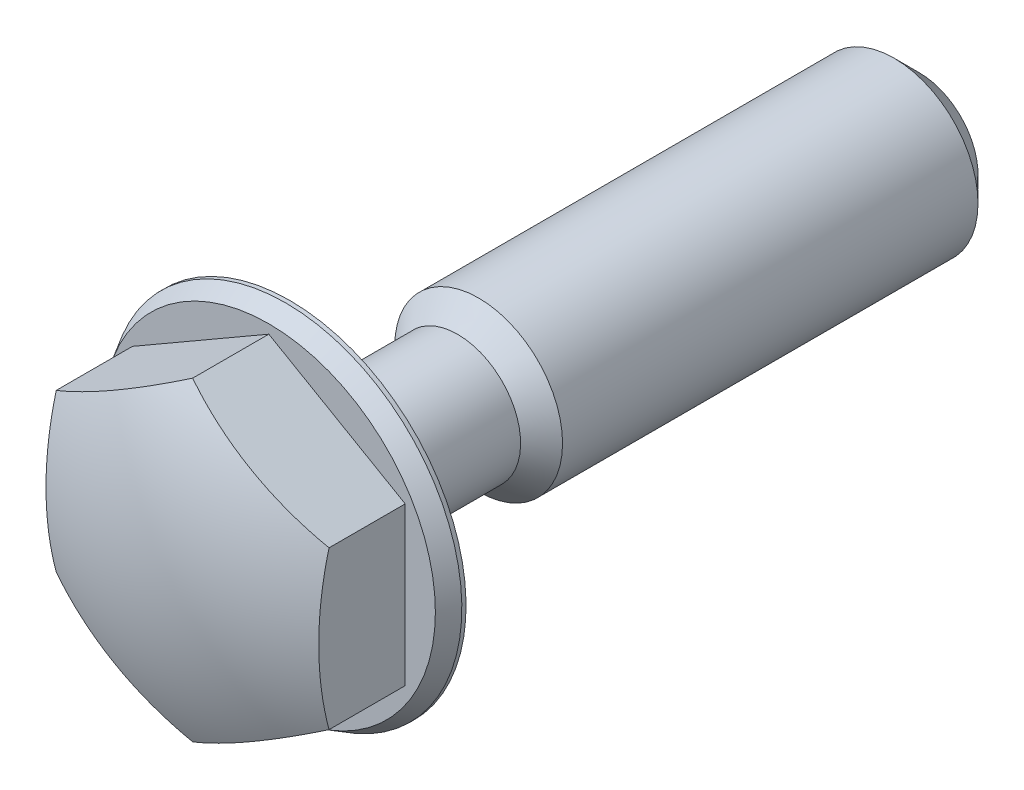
ISO-10303-21;
HEADER;
FILE_DESCRIPTION(('STEP AP214'),'2;1');
FILE_NAME('part.step','',(''),(''),'','','');
FILE_SCHEMA(('AUTOMOTIVE_DESIGN { 1 0 10303 214 1 1 1 1 }'));
ENDSEC;
DATA;
#1=APPLICATION_CONTEXT('core data for automotive mechanical design processes');
#2=APPLICATION_PROTOCOL_DEFINITION('international standard','automotive_design',2000,#1);
#3=PRODUCT_CONTEXT('',#1,'mechanical');
#4=PRODUCT('Part','Part','',(#3));
#5=PRODUCT_RELATED_PRODUCT_CATEGORY('part','',(#4));
#6=PRODUCT_DEFINITION_FORMATION('','',#4);
#7=PRODUCT_DEFINITION_CONTEXT('part definition',#1,'design');
#8=PRODUCT_DEFINITION('design','',#6,#7);
#9=PRODUCT_DEFINITION_SHAPE('','',#8);
#10=(LENGTH_UNIT() NAMED_UNIT(*) SI_UNIT(.MILLI.,.METRE.));
#11=(NAMED_UNIT(*) PLANE_ANGLE_UNIT() SI_UNIT($,.RADIAN.));
#12=(NAMED_UNIT(*) SI_UNIT($,.STERADIAN.) SOLID_ANGLE_UNIT());
#13=UNCERTAINTY_MEASURE_WITH_UNIT(LENGTH_MEASURE(1.E-05),#10,'distance_accuracy_value','');
#14=(GEOMETRIC_REPRESENTATION_CONTEXT(3) GLOBAL_UNCERTAINTY_ASSIGNED_CONTEXT((#13)) GLOBAL_UNIT_ASSIGNED_CONTEXT((#10,
#11,#12)) REPRESENTATION_CONTEXT('',''));
#15=CARTESIAN_POINT('',(0.,0.,0.));
#16=DIRECTION('',(0.,0.,1.));
#17=DIRECTION('',(1.,0.,0.));
#18=AXIS2_PLACEMENT_3D('',#15,#16,#17);
#19=CARTESIAN_POINT('',(0.,0.,-20.));
#20=DIRECTION('',(0.,0.,-1.));
#21=DIRECTION('',(0.,1.,0.));
#22=AXIS2_PLACEMENT_3D('',#19,#20,#21);
#23=CYLINDRICAL_SURFACE('',#22,3.);
#24=CARTESIAN_POINT('',(0.,0.,-0.6));
#25=DIRECTION('',(0.,0.,-1.));
#26=DIRECTION('',(0.,1.,0.));
#27=AXIS2_PLACEMENT_3D('',#24,#25,#26);
#28=CIRCLE('',#27,3.);
#29=CARTESIAN_POINT('',(0.,3.,-0.6));
#30=VERTEX_POINT('',#29);
#31=EDGE_CURVE('E108',#30,#30,#28,.T.);
#32=ORIENTED_EDGE('',*,*,#31,.T.);
#33=EDGE_LOOP('',(#32));
#34=FACE_BOUND('',#33,.T.);
#35=CARTESIAN_POINT('',(0.,0.,-8.));
#36=DIRECTION('',(0.,0.,-1.));
#37=DIRECTION('',(-1.,0.,0.));
#38=AXIS2_PLACEMENT_3D('',#35,#36,#37);
#39=CIRCLE('',#38,3.);
#40=CARTESIAN_POINT('',(-3.,0.,-8.));
#41=VERTEX_POINT('',#40);
#42=EDGE_CURVE('E9',#41,#41,#39,.T.);
#43=ORIENTED_EDGE('',*,*,#42,.F.);
#44=EDGE_LOOP('',(#43));
#45=FACE_BOUND('',#44,.T.);
#46=ADVANCED_FACE('F14',(#34,#45),#23,.T.);
#47=CARTESIAN_POINT('',(0.,0.,1.));
#48=DIRECTION('',(0.,0.,-1.));
#49=DIRECTION('',(0.,1.,0.));
#50=AXIS2_PLACEMENT_3D('',#47,#48,#49);
#51=CONICAL_SURFACE('',#50,7.9381197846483,0.523598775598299);
#52=CARTESIAN_POINT('',(0.,0.,0.2));
#53=DIRECTION('',(0.,0.,-1.));
#54=DIRECTION('',(0.,1.,0.));
#55=AXIS2_PLACEMENT_3D('',#52,#53,#54);
#56=CIRCLE('',#55,8.4);
#57=CARTESIAN_POINT('',(0.,8.4,0.2));
#58=VERTEX_POINT('',#57);
#59=EDGE_CURVE('E117',#58,#58,#56,.T.);
#60=ORIENTED_EDGE('',*,*,#59,.F.);
#61=EDGE_LOOP('',(#60));
#62=FACE_BOUND('',#61,.T.);
#63=CARTESIAN_POINT('',(0.,0.,1.));
#64=DIRECTION('',(0.,0.,1.));
#65=DIRECTION('',(0.,-1.,0.));
#66=AXIS2_PLACEMENT_3D('',#63,#64,#65);
#67=CIRCLE('',#66,7.9381197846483);
#68=CARTESIAN_POINT('',(0.,-7.9381197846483,1.));
#69=VERTEX_POINT('',#68);
#70=EDGE_CURVE('E95',#69,#69,#67,.T.);
#71=ORIENTED_EDGE('',*,*,#70,.F.);
#72=EDGE_LOOP('',(#71));
#73=FACE_BOUND('',#72,.T.);
#74=ADVANCED_FACE('F157',(#62,#73),#51,.T.);
#75=CARTESIAN_POINT('',(0.,0.,-20.));
#76=DIRECTION('',(0.,0.,-1.));
#77=DIRECTION('',(0.,1.,0.));
#78=AXIS2_PLACEMENT_3D('',#75,#76,#77);
#79=CYLINDRICAL_SURFACE('',#78,8.4);
#80=CARTESIAN_POINT('',(0.,0.,0.));
#81=DIRECTION('',(0.,0.,-1.));
#82=DIRECTION('',(0.,1.,0.));
#83=AXIS2_PLACEMENT_3D('',#80,#81,#82);
#84=CIRCLE('',#83,8.4);
#85=CARTESIAN_POINT('',(0.,8.4,0.));
#86=VERTEX_POINT('',#85);
#87=EDGE_CURVE('E114',#86,#86,#84,.T.);
#88=ORIENTED_EDGE('',*,*,#87,.F.);
#89=EDGE_LOOP('',(#88));
#90=FACE_BOUND('',#89,.T.);
#91=ORIENTED_EDGE('',*,*,#59,.T.);
#92=EDGE_LOOP('',(#91));
#93=FACE_BOUND('',#92,.T.);
#94=ADVANCED_FACE('F163',(#90,#93),#79,.T.);
#95=CARTESIAN_POINT('',(8.4,0.,0.));
#96=DIRECTION('',(0.,0.,1.));
#97=DIRECTION('',(0.,-1.,0.));
#98=AXIS2_PLACEMENT_3D('',#95,#96,#97);
#99=PLANE('',#98);
#100=CARTESIAN_POINT('',(0.,0.,0.));
#101=DIRECTION('',(0.,0.,-1.));
#102=DIRECTION('',(0.,1.,0.));
#103=AXIS2_PLACEMENT_3D('',#100,#101,#102);
#104=CIRCLE('',#103,3.6);
#105=CARTESIAN_POINT('',(0.,3.6,0.));
#106=VERTEX_POINT('',#105);
#107=EDGE_CURVE('E111',#106,#106,#104,.T.);
#108=ORIENTED_EDGE('',*,*,#107,.F.);
#109=EDGE_LOOP('',(#108));
#110=FACE_BOUND('',#109,.T.);
#111=ORIENTED_EDGE('',*,*,#87,.T.);
#112=EDGE_LOOP('',(#111));
#113=FACE_BOUND('',#112,.T.);
#114=ADVANCED_FACE('F173',(#110,#113),#99,.F.);
#115=CARTESIAN_POINT('',(0.,0.,-0.6));
#116=DIRECTION('',(0.,0.,-1.));
#117=DIRECTION('',(0.,1.,0.));
#118=AXIS2_PLACEMENT_3D('',#115,#116,#117);
#119=TOROIDAL_SURFACE('',#118,3.6,0.6);
#120=ORIENTED_EDGE('',*,*,#31,.F.);
#121=EDGE_LOOP('',(#120));
#122=FACE_BOUND('',#121,.T.);
#123=ORIENTED_EDGE('',*,*,#107,.T.);
#124=EDGE_LOOP('',(#123));
#125=FACE_BOUND('',#124,.T.);
#126=ADVANCED_FACE('F170',(#122,#125),#119,.F.);
#127=CARTESIAN_POINT('',(0.,0.,1.));
#128=DIRECTION('',(0.,0.,1.));
#129=DIRECTION('',(0.,-1.,0.));
#130=AXIS2_PLACEMENT_3D('',#127,#128,#129);
#131=PLANE('',#130);
#132=DIRECTION('',(0.,-1.,0.));
#133=VECTOR('',#132,1.);
#134=CARTESIAN_POINT('',(-6.5,3.75277674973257,1.));
#135=LINE('',#134,#133);
#136=CARTESIAN_POINT('',(-6.5,3.75277674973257,1.));
#137=VERTEX_POINT('',#136);
#138=CARTESIAN_POINT('',(-6.5,-3.75277674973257,1.));
#139=VERTEX_POINT('',#138);
#140=EDGE_CURVE('E72',#137,#139,#135,.T.);
#141=ORIENTED_EDGE('',*,*,#140,.F.);
#142=DIRECTION('',(-0.866025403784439,-0.5,0.));
#143=VECTOR('',#142,1.);
#144=CARTESIAN_POINT('',(0.,7.50555349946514,1.));
#145=LINE('',#144,#143);
#146=CARTESIAN_POINT('',(0.,7.50555349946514,1.));
#147=VERTEX_POINT('',#146);
#148=EDGE_CURVE('E88',#147,#137,#145,.T.);
#149=ORIENTED_EDGE('',*,*,#148,.F.);
#150=DIRECTION('',(-0.866025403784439,0.5,0.));
#151=VECTOR('',#150,1.);
#152=CARTESIAN_POINT('',(6.5,3.75277674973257,1.));
#153=LINE('',#152,#151);
#154=CARTESIAN_POINT('',(6.5,3.75277674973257,1.));
#155=VERTEX_POINT('',#154);
#156=EDGE_CURVE('E90',#155,#147,#153,.T.);
#157=ORIENTED_EDGE('',*,*,#156,.F.);
#158=DIRECTION('',(0.,1.,0.));
#159=VECTOR('',#158,1.);
#160=CARTESIAN_POINT('',(6.5,-3.75277674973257,1.));
#161=LINE('',#160,#159);
#162=CARTESIAN_POINT('',(6.5,-3.75277674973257,1.));
#163=VERTEX_POINT('',#162);
#164=EDGE_CURVE('E194',#163,#155,#161,.T.);
#165=ORIENTED_EDGE('',*,*,#164,.F.);
#166=DIRECTION('',(0.866025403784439,0.5,0.));
#167=VECTOR('',#166,1.);
#168=CARTESIAN_POINT('',(0.,-7.50555349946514,1.));
#169=LINE('',#168,#167);
#170=CARTESIAN_POINT('',(0.,-7.50555349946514,1.));
#171=VERTEX_POINT('',#170);
#172=EDGE_CURVE('E82',#171,#163,#169,.T.);
#173=ORIENTED_EDGE('',*,*,#172,.F.);
#174=DIRECTION('',(0.866025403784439,-0.5,0.));
#175=VECTOR('',#174,1.);
#176=CARTESIAN_POINT('',(-6.5,-3.75277674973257,1.));
#177=LINE('',#176,#175);
#178=EDGE_CURVE('E68',#139,#171,#177,.T.);
#179=ORIENTED_EDGE('',*,*,#178,.F.);
#180=EDGE_LOOP('',(#141,#149,#157,#165,#173,#179));
#181=FACE_BOUND('',#180,.T.);
#182=ORIENTED_EDGE('',*,*,#70,.T.);
#183=EDGE_LOOP('',(#182));
#184=FACE_BOUND('',#183,.T.);
#185=ADVANCED_FACE('F77',(#181,#184),#131,.T.);
#186=CARTESIAN_POINT('',(-6.5,3.75277674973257,1.));
#187=DIRECTION('',(-1.,0.,0.));
#188=DIRECTION('',(0.,-1.,0.));
#189=AXIS2_PLACEMENT_3D('',#186,#187,#188);
#190=PLANE('',#189);
#191=DIRECTION('',(0.,0.,1.));
#192=VECTOR('',#191,1.);
#193=CARTESIAN_POINT('',(-6.5,3.75277674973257,1.));
#194=LINE('',#193,#192);
#195=CARTESIAN_POINT('',(-6.5,3.75277674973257,4.6303455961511));
#196=VERTEX_POINT('',#195);
#197=EDGE_CURVE('E86',#137,#196,#194,.T.);
#198=ORIENTED_EDGE('',*,*,#197,.F.);
#199=ORIENTED_EDGE('',*,*,#140,.T.);
#200=DIRECTION('',(0.,0.,1.));
#201=VECTOR('',#200,1.);
#202=CARTESIAN_POINT('',(-6.5,-3.75277674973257,1.));
#203=LINE('',#202,#201);
#204=CARTESIAN_POINT('',(-6.5,-3.75277674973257,4.6303455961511));
#205=VERTEX_POINT('',#204);
#206=EDGE_CURVE('E65',#139,#205,#203,.T.);
#207=ORIENTED_EDGE('',*,*,#206,.T.);
#208=CARTESIAN_POINT('',(-6.5,0.,-9.5));
#209=DIRECTION('',(-1.,0.,0.));
#210=DIRECTION('',(0.,-1.,0.));
#211=AXIS2_PLACEMENT_3D('',#208,#209,#210);
#212=CIRCLE('',#211,14.6201915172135);
#213=EDGE_CURVE('E37',#196,#205,#212,.F.);
#214=ORIENTED_EDGE('',*,*,#213,.F.);
#215=EDGE_LOOP('',(#198,#199,#207,#214));
#216=FACE_BOUND('',#215,.T.);
#217=ADVANCED_FACE('F85',(#216),#190,.T.);
#218=CARTESIAN_POINT('',(0.,7.50555349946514,1.));
#219=DIRECTION('',(-0.5,0.866025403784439,0.));
#220=DIRECTION('',(-0.866025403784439,-0.5,0.));
#221=AXIS2_PLACEMENT_3D('',#218,#219,#220);
#222=PLANE('',#221);
#223=DIRECTION('',(0.,0.,1.));
#224=VECTOR('',#223,1.);
#225=CARTESIAN_POINT('',(0.,7.50555349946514,1.));
#226=LINE('',#225,#224);
#227=CARTESIAN_POINT('',(0.,7.50555349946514,4.6303455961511));
#228=VERTEX_POINT('',#227);
#229=EDGE_CURVE('E96',#147,#228,#226,.T.);
#230=ORIENTED_EDGE('',*,*,#229,.F.);
#231=ORIENTED_EDGE('',*,*,#148,.T.);
#232=ORIENTED_EDGE('',*,*,#197,.T.);
#233=CARTESIAN_POINT('',(-3.25,5.62916512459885,-9.5));
#234=DIRECTION('',(-0.5,0.866025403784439,0.));
#235=DIRECTION('',(-0.866025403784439,-0.5,0.));
#236=AXIS2_PLACEMENT_3D('',#233,#234,#235);
#237=CIRCLE('',#236,14.6201915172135);
#238=EDGE_CURVE('E130',#228,#196,#237,.F.);
#239=ORIENTED_EDGE('',*,*,#238,.F.);
#240=EDGE_LOOP('',(#230,#231,#232,#239));
#241=FACE_BOUND('',#240,.T.);
#242=ADVANCED_FACE('F210',(#241),#222,.T.);
#243=CARTESIAN_POINT('',(6.5,3.75277674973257,1.));
#244=DIRECTION('',(0.5,0.866025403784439,0.));
#245=DIRECTION('',(-0.866025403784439,0.5,0.));
#246=AXIS2_PLACEMENT_3D('',#243,#244,#245);
#247=PLANE('',#246);
#248=DIRECTION('',(0.,0.,1.));
#249=VECTOR('',#248,1.);
#250=CARTESIAN_POINT('',(6.5,3.75277674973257,1.));
#251=LINE('',#250,#249);
#252=CARTESIAN_POINT('',(6.5,3.75277674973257,4.6303455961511));
#253=VERTEX_POINT('',#252);
#254=EDGE_CURVE('E99',#155,#253,#251,.T.);
#255=ORIENTED_EDGE('',*,*,#254,.F.);
#256=ORIENTED_EDGE('',*,*,#156,.T.);
#257=ORIENTED_EDGE('',*,*,#229,.T.);
#258=CARTESIAN_POINT('',(3.25,5.62916512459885,-9.5));
#259=DIRECTION('',(0.5,0.866025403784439,0.));
#260=DIRECTION('',(-0.866025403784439,0.5,0.));
#261=AXIS2_PLACEMENT_3D('',#258,#259,#260);
#262=CIRCLE('',#261,14.6201915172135);
#263=EDGE_CURVE('E127',#253,#228,#262,.F.);
#264=ORIENTED_EDGE('',*,*,#263,.F.);
#265=EDGE_LOOP('',(#255,#256,#257,#264));
#266=FACE_BOUND('',#265,.T.);
#267=ADVANCED_FACE('F188',(#266),#247,.T.);
#268=CARTESIAN_POINT('',(6.5,-3.75277674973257,1.));
#269=DIRECTION('',(1.,0.,0.));
#270=DIRECTION('',(0.,1.,0.));
#271=AXIS2_PLACEMENT_3D('',#268,#269,#270);
#272=PLANE('',#271);
#273=DIRECTION('',(0.,0.,1.));
#274=VECTOR('',#273,1.);
#275=CARTESIAN_POINT('',(6.5,-3.75277674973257,1.));
#276=LINE('',#275,#274);
#277=CARTESIAN_POINT('',(6.5,-3.75277674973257,4.6303455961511));
#278=VERTEX_POINT('',#277);
#279=EDGE_CURVE('E102',#163,#278,#276,.T.);
#280=ORIENTED_EDGE('',*,*,#279,.F.);
#281=ORIENTED_EDGE('',*,*,#164,.T.);
#282=ORIENTED_EDGE('',*,*,#254,.T.);
#283=CARTESIAN_POINT('',(6.5,0.,-9.5));
#284=DIRECTION('',(1.,0.,0.));
#285=DIRECTION('',(0.,1.,0.));
#286=AXIS2_PLACEMENT_3D('',#283,#284,#285);
#287=CIRCLE('',#286,14.6201915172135);
#288=EDGE_CURVE('E124',#278,#253,#287,.F.);
#289=ORIENTED_EDGE('',*,*,#288,.F.);
#290=EDGE_LOOP('',(#280,#281,#282,#289));
#291=FACE_BOUND('',#290,.T.);
#292=ADVANCED_FACE('F193',(#291),#272,.T.);
#293=CARTESIAN_POINT('',(0.,-7.50555349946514,1.));
#294=DIRECTION('',(0.5,-0.866025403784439,0.));
#295=DIRECTION('',(0.866025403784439,0.5,0.));
#296=AXIS2_PLACEMENT_3D('',#293,#294,#295);
#297=PLANE('',#296);
#298=DIRECTION('',(0.,0.,1.));
#299=VECTOR('',#298,1.);
#300=CARTESIAN_POINT('',(0.,-7.50555349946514,1.));
#301=LINE('',#300,#299);
#302=CARTESIAN_POINT('',(0.,-7.50555349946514,4.6303455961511));
#303=VERTEX_POINT('',#302);
#304=EDGE_CURVE('E29',#171,#303,#301,.T.);
#305=ORIENTED_EDGE('',*,*,#304,.F.);
#306=ORIENTED_EDGE('',*,*,#172,.T.);
#307=ORIENTED_EDGE('',*,*,#279,.T.);
#308=CARTESIAN_POINT('',(3.25,-5.62916512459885,-9.5));
#309=DIRECTION('',(0.5,-0.866025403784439,0.));
#310=DIRECTION('',(0.866025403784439,0.5,0.));
#311=AXIS2_PLACEMENT_3D('',#308,#309,#310);
#312=CIRCLE('',#311,14.6201915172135);
#313=EDGE_CURVE('E121',#303,#278,#312,.F.);
#314=ORIENTED_EDGE('',*,*,#313,.F.);
#315=EDGE_LOOP('',(#305,#306,#307,#314));
#316=FACE_BOUND('',#315,.T.);
#317=ADVANCED_FACE('F185',(#316),#297,.T.);
#318=CARTESIAN_POINT('',(-6.5,-3.75277674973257,1.));
#319=DIRECTION('',(-0.5,-0.866025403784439,0.));
#320=DIRECTION('',(0.866025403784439,-0.5,0.));
#321=AXIS2_PLACEMENT_3D('',#318,#319,#320);
#322=PLANE('',#321);
#323=ORIENTED_EDGE('',*,*,#206,.F.);
#324=ORIENTED_EDGE('',*,*,#178,.T.);
#325=ORIENTED_EDGE('',*,*,#304,.T.);
#326=CARTESIAN_POINT('',(-3.25,-5.62916512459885,-9.5));
#327=DIRECTION('',(-0.5,-0.866025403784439,0.));
#328=DIRECTION('',(0.866025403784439,-0.5,0.));
#329=AXIS2_PLACEMENT_3D('',#326,#327,#328);
#330=CIRCLE('',#329,14.6201915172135);
#331=EDGE_CURVE('E70',#205,#303,#330,.F.);
#332=ORIENTED_EDGE('',*,*,#331,.F.);
#333=EDGE_LOOP('',(#323,#324,#325,#332));
#334=FACE_BOUND('',#333,.T.);
#335=ADVANCED_FACE('F67',(#334),#322,.T.);
#336=CARTESIAN_POINT('',(0.,0.,-9.5));
#337=DIRECTION('',(0.,0.,-1.));
#338=DIRECTION('',(1.,0.,0.));
#339=AXIS2_PLACEMENT_3D('',#336,#337,#338);
#340=SPHERICAL_SURFACE('',#339,16.);
#341=ORIENTED_EDGE('',*,*,#263,.T.);
#342=ORIENTED_EDGE('',*,*,#238,.T.);
#343=ORIENTED_EDGE('',*,*,#213,.T.);
#344=ORIENTED_EDGE('',*,*,#331,.T.);
#345=ORIENTED_EDGE('',*,*,#313,.T.);
#346=ORIENTED_EDGE('',*,*,#288,.T.);
#347=EDGE_LOOP('',(#341,#342,#343,#344,#345,#346));
#348=FACE_BOUND('',#347,.T.);
#349=ADVANCED_FACE('F152',(#348),#340,.T.);
#350=CARTESIAN_POINT('',(0.,0.,-9.));
#351=DIRECTION('',(0.,0.,-1.));
#352=DIRECTION('',(-1.,0.,0.));
#353=AXIS2_PLACEMENT_3D('',#350,#351,#352);
#354=CONICAL_SURFACE('',#353,4.,0.785398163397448);
#355=ORIENTED_EDGE('',*,*,#42,.T.);
#356=EDGE_LOOP('',(#355));
#357=FACE_BOUND('',#356,.T.);
#358=CARTESIAN_POINT('',(0.,0.,-9.));
#359=DIRECTION('',(0.,0.,1.));
#360=DIRECTION('',(1.,0.,0.));
#361=AXIS2_PLACEMENT_3D('',#358,#359,#360);
#362=CIRCLE('',#361,4.);
#363=CARTESIAN_POINT('',(4.,0.,-9.));
#364=VERTEX_POINT('',#363);
#365=EDGE_CURVE('E83',#364,#364,#362,.T.);
#366=ORIENTED_EDGE('',*,*,#365,.T.);
#367=EDGE_LOOP('',(#366));
#368=FACE_BOUND('',#367,.T.);
#369=ADVANCED_FACE('F146',(#357,#368),#354,.T.);
#370=CARTESIAN_POINT('',(0.,0.,-30.));
#371=DIRECTION('',(0.,0.,-1.));
#372=DIRECTION('',(0.,1.,0.));
#373=AXIS2_PLACEMENT_3D('',#370,#371,#372);
#374=PLANE('',#373);
#375=CARTESIAN_POINT('',(0.,0.,-30.));
#376=DIRECTION('',(0.,0.,-1.));
#377=DIRECTION('',(0.,1.,0.));
#378=AXIS2_PLACEMENT_3D('',#375,#376,#377);
#379=CIRCLE('',#378,2.8);
#380=CARTESIAN_POINT('',(0.,2.8,-30.));
#381=VERTEX_POINT('',#380);
#382=EDGE_CURVE('E133',#381,#381,#379,.T.);
#383=ORIENTED_EDGE('',*,*,#382,.T.);
#384=EDGE_LOOP('',(#383));
#385=FACE_BOUND('',#384,.T.);
#386=ADVANCED_FACE('F142',(#385),#374,.T.);
#387=CARTESIAN_POINT('',(0.,0.,-30.));
#388=DIRECTION('',(0.,0.,1.));
#389=DIRECTION('',(0.,-1.,0.));
#390=AXIS2_PLACEMENT_3D('',#387,#388,#389);
#391=CONICAL_SURFACE('',#390,2.8,0.785398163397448);
#392=CARTESIAN_POINT('',(0.,0.,-28.8));
#393=DIRECTION('',(0.,0.,-1.));
#394=DIRECTION('',(0.,1.,0.));
#395=AXIS2_PLACEMENT_3D('',#392,#393,#394);
#396=CIRCLE('',#395,4.);
#397=CARTESIAN_POINT('',(0.,4.,-28.8));
#398=VERTEX_POINT('',#397);
#399=EDGE_CURVE('E22',#398,#398,#396,.F.);
#400=ORIENTED_EDGE('',*,*,#399,.F.);
#401=EDGE_LOOP('',(#400));
#402=FACE_BOUND('',#401,.T.);
#403=ORIENTED_EDGE('',*,*,#382,.F.);
#404=EDGE_LOOP('',(#403));
#405=FACE_BOUND('',#404,.T.);
#406=ADVANCED_FACE('F16',(#402,#405),#391,.T.);
#407=CARTESIAN_POINT('',(0.,0.,-30.));
#408=DIRECTION('',(0.,0.,1.));
#409=DIRECTION('',(0.,-1.,0.));
#410=AXIS2_PLACEMENT_3D('',#407,#408,#409);
#411=CYLINDRICAL_SURFACE('',#410,4.);
#412=ORIENTED_EDGE('',*,*,#365,.F.);
#413=EDGE_LOOP('',(#412));
#414=FACE_BOUND('',#413,.T.);
#415=ORIENTED_EDGE('',*,*,#399,.T.);
#416=EDGE_LOOP('',(#415));
#417=FACE_BOUND('',#416,.T.);
#418=ADVANCED_FACE('F138',(#414,#417),#411,.T.);
#419=CLOSED_SHELL('',(#46,#74,#94,#114,#126,#185,#217,#242,#267,#292,#317,#335,#349,#369,#386,
#406,#418));
#420=MANIFOLD_SOLID_BREP('B1',#419);
#421=ADVANCED_BREP_SHAPE_REPRESENTATION('',(#18,#420),#14);
#422=SHAPE_DEFINITION_REPRESENTATION(#9,#421);
ENDSEC;
END-ISO-10303-21;
